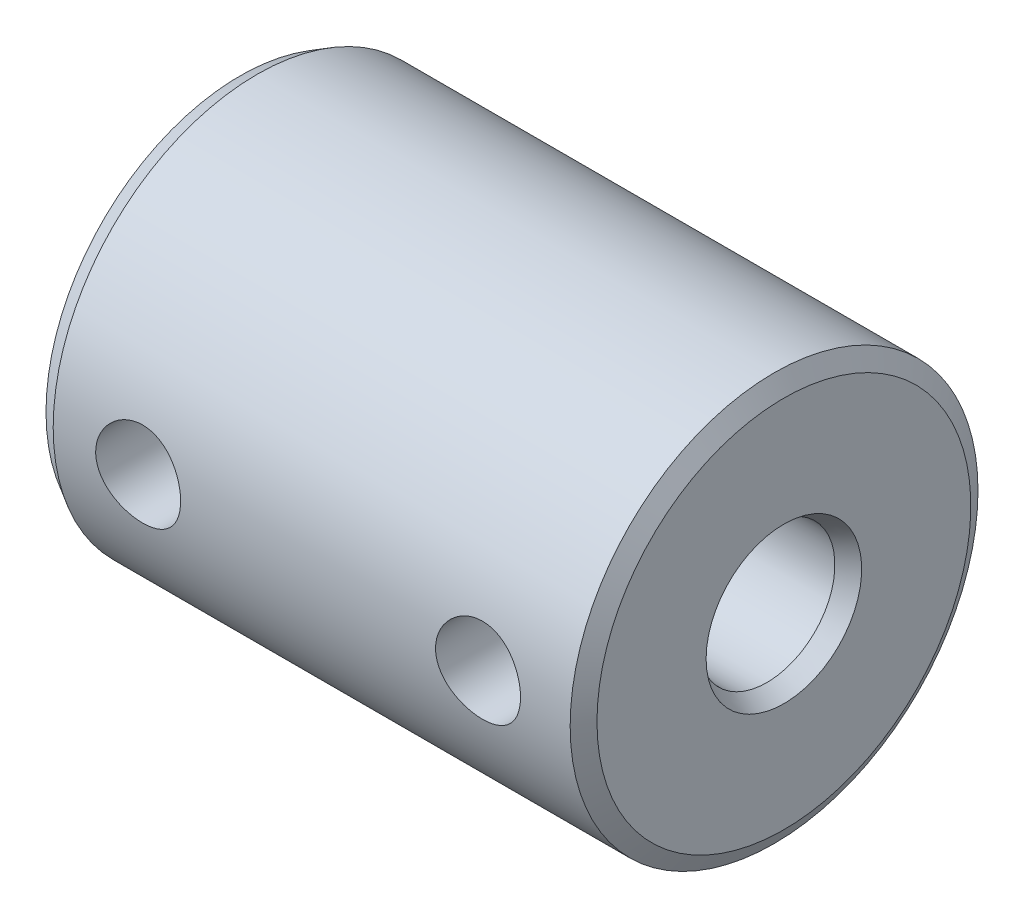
from build123d import *
from OCP.BRepFilletAPI import BRepFilletAPI_MakeChamfer

# Parameters (mm, degrees)
CHANFREIN1_SIZE            = 0.5
CHANFREIN1_SIZE2           = 0.288675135
ESQUISSE2_W                = 1.25
ESQUISSE2_H                = 6
TROU_TARAUD_M31_AT_2_COUNT = 2
TROU_TARAUD_M31_AT_2_PITCH = 10


with BuildPart() as part:
    # Esquisse1 → R_volution1 (revolve)
    with BuildSketch(Plane.XY, mode=Mode.PRIVATE) as r_volution1_sk:
        Polygon((0, 3), (0, 6), (16, 6), (16, 2), (8, 2), (8, 3), align=None)
    revolve(r_volution1_sk.sketch.rotate(Axis((0, 0, 0), (1, 0, 0)), 90), axis=Axis((0, 0, 0), (1, 0, 0)))

    # Chanfrein1: one chamfer whose edges measure the first distance from different faces: ONE call of the kernel's chamfer builder (chamfer() names one face for all edges)
    chanfrein1_edges_1 = [part.edges().sort_by_distance(p)[0] for p in [
        (16, 0, -2),
    ]]
    chanfrein1_side_1 = [part.faces().sort_by_distance(p)[0] for p in [
        (12, 0, -2),
    ]]
    chanfrein1_edges_2 = [part.edges().sort_by_distance(p)[0] for p in [
        (16, 0, -6),
    ]]
    chanfrein1_side_2 = [part.faces().sort_by_distance(p)[0] for p in [
        (16, 0, -5.830294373),
    ]]
    chanfrein1_edges_3 = [part.edges().sort_by_distance(p)[0] for p in [
        (0, 0, -6),
    ]]
    chanfrein1_side_3 = [part.faces().sort_by_distance(p)[0] for p in [
        (8, 0, -6),
    ]]
    chanfrein1_edges_4 = [part.edges().sort_by_distance(p)[0] for p in [
        (0, 0, -3),
    ]]
    chanfrein1_side_4 = [part.faces().sort_by_distance(p)[0] for p in [
        (0, 0, -3.169705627),
    ]]
    chanfrein1 = BRepFilletAPI_MakeChamfer(part.part.solid().wrapped)
    for e in chanfrein1_edges_1:
        chanfrein1.Add(CHANFREIN1_SIZE, CHANFREIN1_SIZE2, e.wrapped, chanfrein1_side_1[0].wrapped)  # the first distance lies on this face
    for e in chanfrein1_edges_2:
        chanfrein1.Add(CHANFREIN1_SIZE, CHANFREIN1_SIZE2, e.wrapped, chanfrein1_side_2[0].wrapped)  # the first distance lies on this face
    for e in chanfrein1_edges_3:
        chanfrein1.Add(CHANFREIN1_SIZE, CHANFREIN1_SIZE2, e.wrapped, chanfrein1_side_3[0].wrapped)  # the first distance lies on this face
    for e in chanfrein1_edges_4:
        chanfrein1.Add(CHANFREIN1_SIZE, CHANFREIN1_SIZE2, e.wrapped, chanfrein1_side_4[0].wrapped)  # the first distance lies on this face
    add(Compound.cast(chanfrein1.Shape()), mode=Mode.REPLACE)

    # Esquisse2 → Trou taraud_ M31 (revolve, cut)
    with BuildSketch(Plane.YZ.offset(3)):
        with Locations((0.625, 3)):
            Rectangle(ESQUISSE2_W, ESQUISSE2_H)
    trou_taraud_m31 = revolve(axis=Axis((3, 0, -6.35), (0, 0, 1)), mode=Mode.SUBTRACT)

    # Trou taraud_ M31 at 2: Trou taraud_ M31 ×2
    with Locations(*[(i * TROU_TARAUD_M31_AT_2_PITCH, 0, 0) for i in range(1, TROU_TARAUD_M31_AT_2_COUNT)]):
        add(trou_taraud_m31, mode=Mode.SUBTRACT)


solid = part.part
